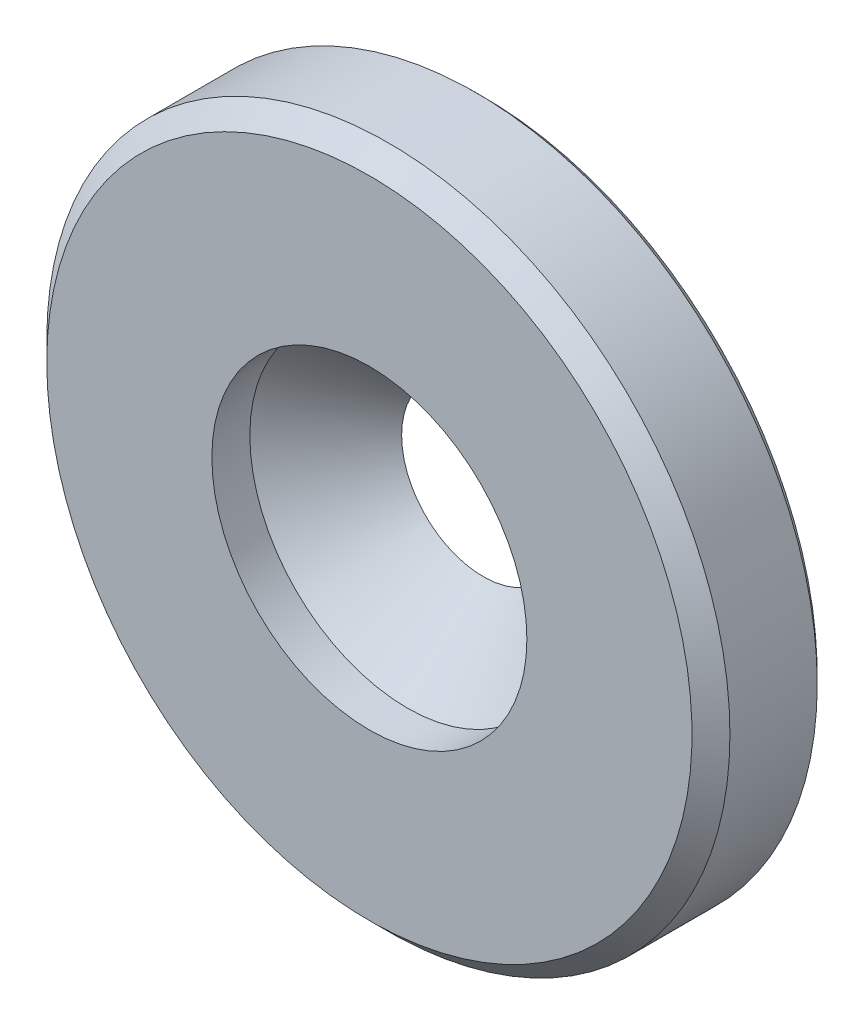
from build123d import *


with BuildPart() as part:
    # Sketch1 → Revolve1 (revolve)
    with BuildSketch(Plane(origin=(0, -18, -1.35), x_dir=(0, 0, -1), z_dir=(1, 0, 0)), mode=Mode.PRIVATE) as revolve1_sk:
        Polygon((-1.35, 20.15), (-1.35, 26.8), (-1.55, 27), (-3.85, 27), (-4.35, 26.5), (-4.35, 22.15), (-3.35, 22.15), align=None)
    revolve(revolve1_sk.sketch.rotate(Axis((0, 0, 0), (0, 0, 1)), 90), axis=Axis((0, 0, 0), (0, 0, 1)))


solid = part.part
